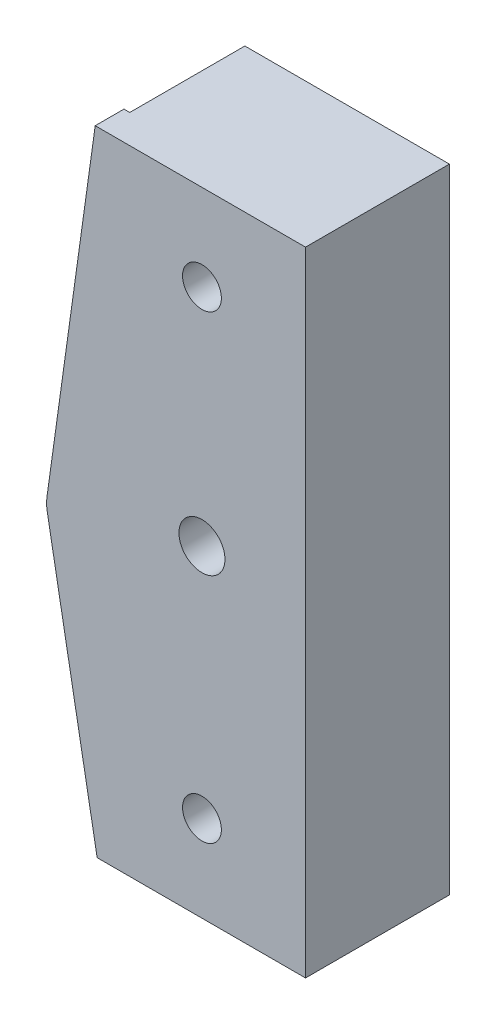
ISO-10303-21;
HEADER;
FILE_DESCRIPTION(('STEP AP214'),'2;1');
FILE_NAME('part.step','',(''),(''),'','','');
FILE_SCHEMA(('AUTOMOTIVE_DESIGN { 1 0 10303 214 1 1 1 1 }'));
ENDSEC;
DATA;
#1=APPLICATION_CONTEXT('core data for automotive mechanical design processes');
#2=APPLICATION_PROTOCOL_DEFINITION('international standard','automotive_design',2000,#1);
#3=PRODUCT_CONTEXT('',#1,'mechanical');
#4=PRODUCT('Part','Part','',(#3));
#5=PRODUCT_RELATED_PRODUCT_CATEGORY('part','',(#4));
#6=PRODUCT_DEFINITION_FORMATION('','',#4);
#7=PRODUCT_DEFINITION_CONTEXT('part definition',#1,'design');
#8=PRODUCT_DEFINITION('design','',#6,#7);
#9=PRODUCT_DEFINITION_SHAPE('','',#8);
#10=(LENGTH_UNIT() NAMED_UNIT(*) SI_UNIT(.MILLI.,.METRE.));
#11=(NAMED_UNIT(*) PLANE_ANGLE_UNIT() SI_UNIT($,.RADIAN.));
#12=(NAMED_UNIT(*) SI_UNIT($,.STERADIAN.) SOLID_ANGLE_UNIT());
#13=UNCERTAINTY_MEASURE_WITH_UNIT(LENGTH_MEASURE(1.E-05),#10,'distance_accuracy_value','');
#14=(GEOMETRIC_REPRESENTATION_CONTEXT(3) GLOBAL_UNCERTAINTY_ASSIGNED_CONTEXT((#13)) GLOBAL_UNIT_ASSIGNED_CONTEXT((#10,
#11,#12)) REPRESENTATION_CONTEXT('',''));
#15=CARTESIAN_POINT('',(0.,0.,0.));
#16=DIRECTION('',(0.,0.,1.));
#17=DIRECTION('',(1.,0.,0.));
#18=AXIS2_PLACEMENT_3D('',#15,#16,#17);
#19=CARTESIAN_POINT('',(62.9999999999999,96.5,25.));
#20=DIRECTION('',(0.,0.,-1.));
#21=DIRECTION('',(-1.,0.,0.));
#22=AXIS2_PLACEMENT_3D('',#19,#20,#21);
#23=CYLINDRICAL_SURFACE('',#22,7.00000000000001);
#24=CARTESIAN_POINT('',(62.9999999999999,96.5,20.));
#25=DIRECTION('',(0.,0.,-1.));
#26=DIRECTION('',(-1.,0.,0.));
#27=AXIS2_PLACEMENT_3D('',#24,#25,#26);
#28=CIRCLE('',#27,7.00000000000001);
#29=CARTESIAN_POINT('',(56.067236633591,97.4678802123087,20.));
#30=VERTEX_POINT('',#29);
#31=CARTESIAN_POINT('',(56.1127179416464,95.2488621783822,20.));
#32=VERTEX_POINT('',#31);
#33=EDGE_CURVE('E139',#30,#32,#28,.F.);
#34=ORIENTED_EDGE('',*,*,#33,.T.);
#35=DIRECTION('',(0.,0.,-1.));
#36=VECTOR('',#35,1.);
#37=CARTESIAN_POINT('',(56.1127179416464,95.2488621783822,25.));
#38=LINE('',#37,#36);
#39=CARTESIAN_POINT('',(56.1127179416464,95.2488621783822,25.));
#40=VERTEX_POINT('',#39);
#41=EDGE_CURVE('E40',#40,#32,#38,.T.);
#42=ORIENTED_EDGE('',*,*,#41,.F.);
#43=CARTESIAN_POINT('',(62.9999999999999,96.5,25.));
#44=DIRECTION('',(0.,0.,1.));
#45=DIRECTION('',(1.,0.,0.));
#46=AXIS2_PLACEMENT_3D('',#43,#44,#45);
#47=CIRCLE('',#46,7.00000000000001);
#48=CARTESIAN_POINT('',(56.067236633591,97.4678802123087,25.));
#49=VERTEX_POINT('',#48);
#50=EDGE_CURVE('E163',#49,#40,#47,.T.);
#51=ORIENTED_EDGE('',*,*,#50,.F.);
#52=DIRECTION('',(0.,0.,-1.));
#53=VECTOR('',#52,1.);
#54=CARTESIAN_POINT('',(56.067236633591,97.4678802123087,25.));
#55=LINE('',#54,#53);
#56=EDGE_CURVE('E174',#49,#30,#55,.T.);
#57=ORIENTED_EDGE('',*,*,#56,.T.);
#58=EDGE_LOOP('',(#34,#42,#51,#57));
#59=FACE_BOUND('',#58,.T.);
#60=ADVANCED_FACE('F33',(#59),#23,.T.);
#61=CARTESIAN_POINT('',(56.1127179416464,95.2488621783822,25.));
#62=DIRECTION('',(0.983897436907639,0.178733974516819,0.));
#63=DIRECTION('',(-0.178733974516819,0.983897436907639,0.));
#64=AXIS2_PLACEMENT_3D('',#61,#62,#63);
#65=PLANE('',#64);
#66=DIRECTION('',(0.178733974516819,-0.983897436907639,0.));
#67=VECTOR('',#66,1.);
#68=CARTESIAN_POINT('',(56.1127179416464,95.2488621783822,20.));
#69=LINE('',#68,#67);
#70=CARTESIAN_POINT('',(64.786735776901,47.5,20.));
#71=VERTEX_POINT('',#70);
#72=EDGE_CURVE('E131',#32,#71,#69,.T.);
#73=ORIENTED_EDGE('',*,*,#72,.T.);
#74=DIRECTION('',(0.,0.,-1.));
#75=VECTOR('',#74,1.);
#76=CARTESIAN_POINT('',(64.786735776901,47.5,25.));
#77=LINE('',#76,#75);
#78=CARTESIAN_POINT('',(64.786735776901,47.5,25.));
#79=VERTEX_POINT('',#78);
#80=EDGE_CURVE('E186',#79,#71,#77,.T.);
#81=ORIENTED_EDGE('',*,*,#80,.F.);
#82=DIRECTION('',(0.178733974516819,-0.983897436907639,0.));
#83=VECTOR('',#82,1.);
#84=CARTESIAN_POINT('',(56.1127179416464,95.2488621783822,25.));
#85=LINE('',#84,#83);
#86=EDGE_CURVE('E165',#40,#79,#85,.T.);
#87=ORIENTED_EDGE('',*,*,#86,.F.);
#88=ORIENTED_EDGE('',*,*,#41,.T.);
#89=EDGE_LOOP('',(#73,#81,#87,#88));
#90=FACE_BOUND('',#89,.T.);
#91=ADVANCED_FACE('F191',(#90),#65,.F.);
#92=CARTESIAN_POINT('',(64.448295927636,157.5,25.));
#93=DIRECTION('',(0.990394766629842,-0.138268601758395,0.));
#94=DIRECTION('',(0.138268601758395,0.990394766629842,0.));
#95=AXIS2_PLACEMENT_3D('',#92,#93,#94);
#96=PLANE('',#95);
#97=DIRECTION('',(-0.138268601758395,-0.990394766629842,0.));
#98=VECTOR('',#97,1.);
#99=CARTESIAN_POINT('',(66.0809221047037,169.194227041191,20.));
#100=LINE('',#99,#98);
#101=CARTESIAN_POINT('',(64.448295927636,157.5,20.));
#102=VERTEX_POINT('',#101);
#103=EDGE_CURVE('E142',#102,#30,#100,.T.);
#104=ORIENTED_EDGE('',*,*,#103,.T.);
#105=ORIENTED_EDGE('',*,*,#56,.F.);
#106=DIRECTION('',(-0.138268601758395,-0.990394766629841,0.));
#107=VECTOR('',#106,1.);
#108=CARTESIAN_POINT('',(64.448295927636,157.5,25.));
#109=LINE('',#108,#107);
#110=CARTESIAN_POINT('',(64.448295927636,157.5,25.));
#111=VERTEX_POINT('',#110);
#112=EDGE_CURVE('E54',#111,#49,#109,.T.);
#113=ORIENTED_EDGE('',*,*,#112,.F.);
#114=DIRECTION('',(0.,0.,-1.));
#115=VECTOR('',#114,1.);
#116=CARTESIAN_POINT('',(64.448295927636,157.5,25.));
#117=LINE('',#116,#115);
#118=EDGE_CURVE('E177',#111,#102,#117,.T.);
#119=ORIENTED_EDGE('',*,*,#118,.T.);
#120=EDGE_LOOP('',(#104,#105,#113,#119));
#121=FACE_BOUND('',#120,.T.);
#122=ADVANCED_FACE('F199',(#121),#96,.F.);
#123=CARTESIAN_POINT('',(64.786735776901,47.5,25.));
#124=DIRECTION('',(0.,1.,0.));
#125=DIRECTION('',(-1.,0.,0.));
#126=AXIS2_PLACEMENT_3D('',#123,#124,#125);
#127=PLANE('',#126);
#128=DIRECTION('',(-1.,0.,0.));
#129=VECTOR('',#128,1.);
#130=CARTESIAN_POINT('',(64.786735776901,47.5,20.));
#131=LINE('',#130,#129);
#132=CARTESIAN_POINT('',(65.8031018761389,47.5,20.));
#133=VERTEX_POINT('',#132);
#134=EDGE_CURVE('E155',#133,#71,#131,.T.);
#135=ORIENTED_EDGE('',*,*,#134,.F.);
#136=DIRECTION('',(0.,0.,-1.));
#137=VECTOR('',#136,1.);
#138=CARTESIAN_POINT('',(65.8031018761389,47.5,25.));
#139=LINE('',#138,#137);
#140=CARTESIAN_POINT('',(65.8031018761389,47.5,0.));
#141=VERTEX_POINT('',#140);
#142=EDGE_CURVE('E150',#133,#141,#139,.T.);
#143=ORIENTED_EDGE('',*,*,#142,.T.);
#144=DIRECTION('',(1.,0.,0.));
#145=VECTOR('',#144,1.);
#146=CARTESIAN_POINT('',(64.786735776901,47.5,0.));
#147=LINE('',#146,#145);
#148=CARTESIAN_POINT('',(101.,47.5,0.));
#149=VERTEX_POINT('',#148);
#150=EDGE_CURVE('E157',#141,#149,#147,.T.);
#151=ORIENTED_EDGE('',*,*,#150,.T.);
#152=DIRECTION('',(0.,0.,-1.));
#153=VECTOR('',#152,1.);
#154=CARTESIAN_POINT('',(101.,47.5,25.));
#155=LINE('',#154,#153);
#156=CARTESIAN_POINT('',(101.,47.5,25.));
#157=VERTEX_POINT('',#156);
#158=EDGE_CURVE('E183',#157,#149,#155,.T.);
#159=ORIENTED_EDGE('',*,*,#158,.F.);
#160=DIRECTION('',(1.,0.,0.));
#161=VECTOR('',#160,1.);
#162=CARTESIAN_POINT('',(64.786735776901,47.5,25.));
#163=LINE('',#162,#161);
#164=EDGE_CURVE('E167',#79,#157,#163,.T.);
#165=ORIENTED_EDGE('',*,*,#164,.F.);
#166=ORIENTED_EDGE('',*,*,#80,.T.);
#167=EDGE_LOOP('',(#135,#143,#151,#159,#165,#166));
#168=FACE_BOUND('',#167,.T.);
#169=ADVANCED_FACE('F208',(#168),#127,.F.);
#170=CARTESIAN_POINT('',(101.,157.5,25.));
#171=DIRECTION('',(-1.,0.,0.));
#172=DIRECTION('',(0.,0.,1.));
#173=AXIS2_PLACEMENT_3D('',#170,#171,#172);
#174=PLANE('',#173);
#175=DIRECTION('',(0.,1.,0.));
#176=VECTOR('',#175,1.);
#177=CARTESIAN_POINT('',(101.,157.5,0.));
#178=LINE('',#177,#176);
#179=CARTESIAN_POINT('',(101.,157.5,0.));
#180=VERTEX_POINT('',#179);
#181=EDGE_CURVE('E159',#149,#180,#178,.T.);
#182=ORIENTED_EDGE('',*,*,#181,.T.);
#183=DIRECTION('',(0.,0.,-1.));
#184=VECTOR('',#183,1.);
#185=CARTESIAN_POINT('',(101.,157.5,25.));
#186=LINE('',#185,#184);
#187=CARTESIAN_POINT('',(101.,157.5,25.));
#188=VERTEX_POINT('',#187);
#189=EDGE_CURVE('E180',#188,#180,#186,.T.);
#190=ORIENTED_EDGE('',*,*,#189,.F.);
#191=DIRECTION('',(0.,1.,0.));
#192=VECTOR('',#191,1.);
#193=CARTESIAN_POINT('',(101.,157.5,25.));
#194=LINE('',#193,#192);
#195=EDGE_CURVE('E169',#157,#188,#194,.T.);
#196=ORIENTED_EDGE('',*,*,#195,.F.);
#197=ORIENTED_EDGE('',*,*,#158,.T.);
#198=EDGE_LOOP('',(#182,#190,#196,#197));
#199=FACE_BOUND('',#198,.T.);
#200=ADVANCED_FACE('F215',(#199),#174,.F.);
#201=CARTESIAN_POINT('',(101.,157.5,25.));
#202=DIRECTION('',(0.,-1.,0.));
#203=DIRECTION('',(0.,0.,-1.));
#204=AXIS2_PLACEMENT_3D('',#201,#202,#203);
#205=PLANE('',#204);
#206=DIRECTION('',(-1.,0.,0.));
#207=VECTOR('',#206,1.);
#208=CARTESIAN_POINT('',(101.,157.5,0.));
#209=LINE('',#208,#207);
#210=CARTESIAN_POINT('',(65.4579943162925,157.5,0.));
#211=VERTEX_POINT('',#210);
#212=EDGE_CURVE('E161',#180,#211,#209,.T.);
#213=ORIENTED_EDGE('',*,*,#212,.T.);
#214=DIRECTION('',(0.,0.,1.));
#215=VECTOR('',#214,1.);
#216=CARTESIAN_POINT('',(65.4579943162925,157.5,25.));
#217=LINE('',#216,#215);
#218=CARTESIAN_POINT('',(65.4579943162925,157.5,20.));
#219=VERTEX_POINT('',#218);
#220=EDGE_CURVE('E47',#211,#219,#217,.T.);
#221=ORIENTED_EDGE('',*,*,#220,.T.);
#222=DIRECTION('',(1.,0.,0.));
#223=VECTOR('',#222,1.);
#224=CARTESIAN_POINT('',(101.,157.5,20.));
#225=LINE('',#224,#223);
#226=EDGE_CURVE('E153',#102,#219,#225,.T.);
#227=ORIENTED_EDGE('',*,*,#226,.F.);
#228=ORIENTED_EDGE('',*,*,#118,.F.);
#229=DIRECTION('',(-1.,0.,0.));
#230=VECTOR('',#229,1.);
#231=CARTESIAN_POINT('',(101.,157.5,25.));
#232=LINE('',#231,#230);
#233=EDGE_CURVE('E171',#188,#111,#232,.T.);
#234=ORIENTED_EDGE('',*,*,#233,.F.);
#235=ORIENTED_EDGE('',*,*,#189,.T.);
#236=EDGE_LOOP('',(#213,#221,#227,#228,#234,#235));
#237=FACE_BOUND('',#236,.T.);
#238=ADVANCED_FACE('F203',(#237),#205,.F.);
#239=CARTESIAN_POINT('',(62.9999999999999,96.5,25.));
#240=DIRECTION('',(0.,0.,1.));
#241=DIRECTION('',(1.,0.,0.));
#242=AXIS2_PLACEMENT_3D('',#239,#240,#241);
#243=PLANE('',#242);
#244=CARTESIAN_POINT('',(83.,62.5,25.));
#245=DIRECTION('',(0.,0.,-1.));
#246=DIRECTION('',(-1.,0.,0.));
#247=AXIS2_PLACEMENT_3D('',#244,#245,#246);
#248=CIRCLE('',#247,3.375);
#249=CARTESIAN_POINT('',(79.625,62.5,25.));
#250=VERTEX_POINT('',#249);
#251=EDGE_CURVE('E267',#250,#250,#248,.T.);
#252=ORIENTED_EDGE('',*,*,#251,.T.);
#253=EDGE_LOOP('',(#252));
#254=FACE_BOUND('',#253,.T.);
#255=CARTESIAN_POINT('',(83.,103.5,25.));
#256=DIRECTION('',(0.,0.,-1.));
#257=DIRECTION('',(-1.,0.,0.));
#258=AXIS2_PLACEMENT_3D('',#255,#256,#257);
#259=CIRCLE('',#258,4.00000000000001);
#260=CARTESIAN_POINT('',(79.,103.5,25.));
#261=VERTEX_POINT('',#260);
#262=EDGE_CURVE('E277',#261,#261,#259,.T.);
#263=ORIENTED_EDGE('',*,*,#262,.T.);
#264=EDGE_LOOP('',(#263));
#265=FACE_BOUND('',#264,.T.);
#266=CARTESIAN_POINT('',(83.,142.5,25.));
#267=DIRECTION('',(0.,0.,-1.));
#268=DIRECTION('',(-1.,0.,0.));
#269=AXIS2_PLACEMENT_3D('',#266,#267,#268);
#270=CIRCLE('',#269,3.375);
#271=CARTESIAN_POINT('',(79.625,142.5,25.));
#272=VERTEX_POINT('',#271);
#273=EDGE_CURVE('E133',#272,#272,#270,.T.);
#274=ORIENTED_EDGE('',*,*,#273,.T.);
#275=EDGE_LOOP('',(#274));
#276=FACE_BOUND('',#275,.T.);
#277=ORIENTED_EDGE('',*,*,#50,.T.);
#278=ORIENTED_EDGE('',*,*,#86,.T.);
#279=ORIENTED_EDGE('',*,*,#164,.T.);
#280=ORIENTED_EDGE('',*,*,#195,.T.);
#281=ORIENTED_EDGE('',*,*,#233,.T.);
#282=ORIENTED_EDGE('',*,*,#112,.T.);
#283=EDGE_LOOP('',(#277,#278,#279,#280,#281,#282));
#284=FACE_BOUND('',#283,.T.);
#285=ADVANCED_FACE('F212',(#254,#265,#276,#284),#243,.T.);
#286=CARTESIAN_POINT('',(62.9999999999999,96.5,0.));
#287=DIRECTION('',(0.,0.,1.));
#288=DIRECTION('',(1.,0.,0.));
#289=AXIS2_PLACEMENT_3D('',#286,#287,#288);
#290=PLANE('',#289);
#291=CARTESIAN_POINT('',(83.,62.5,0.));
#292=DIRECTION('',(0.,0.,-1.));
#293=DIRECTION('',(-1.,0.,0.));
#294=AXIS2_PLACEMENT_3D('',#291,#292,#293);
#295=CIRCLE('',#294,3.375);
#296=CARTESIAN_POINT('',(79.625,62.5,0.));
#297=VERTEX_POINT('',#296);
#298=EDGE_CURVE('E270',#297,#297,#295,.T.);
#299=ORIENTED_EDGE('',*,*,#298,.F.);
#300=EDGE_LOOP('',(#299));
#301=FACE_BOUND('',#300,.T.);
#302=CARTESIAN_POINT('',(83.,103.5,0.));
#303=DIRECTION('',(0.,0.,-1.));
#304=DIRECTION('',(-1.,0.,0.));
#305=AXIS2_PLACEMENT_3D('',#302,#303,#304);
#306=CIRCLE('',#305,4.00000000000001);
#307=CARTESIAN_POINT('',(79.,103.5,0.));
#308=VERTEX_POINT('',#307);
#309=EDGE_CURVE('E272',#308,#308,#306,.T.);
#310=ORIENTED_EDGE('',*,*,#309,.F.);
#311=EDGE_LOOP('',(#310));
#312=FACE_BOUND('',#311,.T.);
#313=CARTESIAN_POINT('',(83.,142.5,0.));
#314=DIRECTION('',(0.,0.,-1.));
#315=DIRECTION('',(-1.,0.,0.));
#316=AXIS2_PLACEMENT_3D('',#313,#314,#315);
#317=CIRCLE('',#316,3.375);
#318=CARTESIAN_POINT('',(79.625,142.5,0.));
#319=VERTEX_POINT('',#318);
#320=EDGE_CURVE('E280',#319,#319,#317,.T.);
#321=ORIENTED_EDGE('',*,*,#320,.F.);
#322=EDGE_LOOP('',(#321));
#323=FACE_BOUND('',#322,.T.);
#324=ORIENTED_EDGE('',*,*,#150,.F.);
#325=DIRECTION('',(0.178733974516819,-0.983897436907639,0.));
#326=VECTOR('',#325,1.);
#327=CARTESIAN_POINT('',(57.0966153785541,95.4275961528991,0.));
#328=LINE('',#327,#326);
#329=CARTESIAN_POINT('',(57.0966153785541,95.4275961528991,0.));
#330=VERTEX_POINT('',#329);
#331=EDGE_CURVE('E127',#330,#141,#328,.T.);
#332=ORIENTED_EDGE('',*,*,#331,.F.);
#333=CARTESIAN_POINT('',(62.9999999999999,96.5,0.));
#334=DIRECTION('',(0.,0.,1.));
#335=DIRECTION('',(-1.,0.,0.));
#336=AXIS2_PLACEMENT_3D('',#333,#334,#335);
#337=CIRCLE('',#336,6.00000000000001);
#338=CARTESIAN_POINT('',(57.0576314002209,97.3296116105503,0.));
#339=VERTEX_POINT('',#338);
#340=EDGE_CURVE('E119',#339,#330,#337,.T.);
#341=ORIENTED_EDGE('',*,*,#340,.F.);
#342=DIRECTION('',(0.138268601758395,0.990394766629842,0.));
#343=VECTOR('',#342,1.);
#344=CARTESIAN_POINT('',(57.0576314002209,97.3296116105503,0.));
#345=LINE('',#344,#343);
#346=EDGE_CURVE('E11',#339,#211,#345,.T.);
#347=ORIENTED_EDGE('',*,*,#346,.T.);
#348=ORIENTED_EDGE('',*,*,#212,.F.);
#349=ORIENTED_EDGE('',*,*,#181,.F.);
#350=EDGE_LOOP('',(#324,#332,#341,#347,#348,#349));
#351=FACE_BOUND('',#350,.T.);
#352=ADVANCED_FACE('F126',(#301,#312,#323,#351),#290,.F.);
#353=CARTESIAN_POINT('',(62.9999999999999,96.5,20.));
#354=DIRECTION('',(0.,0.,-1.));
#355=DIRECTION('',(-1.,0.,0.));
#356=AXIS2_PLACEMENT_3D('',#353,#354,#355);
#357=PLANE('',#356);
#358=ORIENTED_EDGE('',*,*,#134,.T.);
#359=ORIENTED_EDGE('',*,*,#72,.F.);
#360=ORIENTED_EDGE('',*,*,#33,.F.);
#361=ORIENTED_EDGE('',*,*,#103,.F.);
#362=ORIENTED_EDGE('',*,*,#226,.T.);
#363=DIRECTION('',(-0.138268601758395,-0.990394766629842,0.));
#364=VECTOR('',#363,1.);
#365=CARTESIAN_POINT('',(67.0713168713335,169.055958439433,20.));
#366=LINE('',#365,#364);
#367=CARTESIAN_POINT('',(57.0576314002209,97.3296116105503,20.));
#368=VERTEX_POINT('',#367);
#369=EDGE_CURVE('E145',#219,#368,#366,.T.);
#370=ORIENTED_EDGE('',*,*,#369,.T.);
#371=CARTESIAN_POINT('',(62.9999999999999,96.5,20.));
#372=DIRECTION('',(0.,0.,1.));
#373=DIRECTION('',(-1.,0.,0.));
#374=AXIS2_PLACEMENT_3D('',#371,#372,#373);
#375=CIRCLE('',#374,6.00000000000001);
#376=CARTESIAN_POINT('',(57.0966153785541,95.4275961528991,20.));
#377=VERTEX_POINT('',#376);
#378=EDGE_CURVE('E122',#368,#377,#375,.T.);
#379=ORIENTED_EDGE('',*,*,#378,.T.);
#380=DIRECTION('',(0.178733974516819,-0.983897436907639,0.));
#381=VECTOR('',#380,1.);
#382=CARTESIAN_POINT('',(57.0966153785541,95.4275961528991,20.));
#383=LINE('',#382,#381);
#384=EDGE_CURVE('E128',#377,#133,#383,.T.);
#385=ORIENTED_EDGE('',*,*,#384,.T.);
#386=EDGE_LOOP('',(#358,#359,#360,#361,#362,#370,#379,#385));
#387=FACE_BOUND('',#386,.T.);
#388=ADVANCED_FACE('F196',(#387),#357,.T.);
#389=CARTESIAN_POINT('',(57.0966153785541,95.4275961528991,20.));
#390=DIRECTION('',(0.983897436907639,0.178733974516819,0.));
#391=DIRECTION('',(-0.178733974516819,0.983897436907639,0.));
#392=AXIS2_PLACEMENT_3D('',#389,#390,#391);
#393=PLANE('',#392);
#394=ORIENTED_EDGE('',*,*,#384,.F.);
#395=DIRECTION('',(0.,0.,-1.));
#396=VECTOR('',#395,1.);
#397=CARTESIAN_POINT('',(57.0966153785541,95.4275961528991,20.));
#398=LINE('',#397,#396);
#399=EDGE_CURVE('E123',#377,#330,#398,.T.);
#400=ORIENTED_EDGE('',*,*,#399,.T.);
#401=ORIENTED_EDGE('',*,*,#331,.T.);
#402=ORIENTED_EDGE('',*,*,#142,.F.);
#403=EDGE_LOOP('',(#394,#400,#401,#402));
#404=FACE_BOUND('',#403,.T.);
#405=ADVANCED_FACE('F242',(#404),#393,.F.);
#406=CARTESIAN_POINT('',(67.0713168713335,169.055958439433,20.));
#407=DIRECTION('',(0.990394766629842,-0.138268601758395,0.));
#408=DIRECTION('',(0.138268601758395,0.990394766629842,0.));
#409=AXIS2_PLACEMENT_3D('',#406,#407,#408);
#410=PLANE('',#409);
#411=ORIENTED_EDGE('',*,*,#346,.F.);
#412=DIRECTION('',(0.,0.,-1.));
#413=VECTOR('',#412,1.);
#414=CARTESIAN_POINT('',(57.0576314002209,97.3296116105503,20.));
#415=LINE('',#414,#413);
#416=EDGE_CURVE('E110',#368,#339,#415,.T.);
#417=ORIENTED_EDGE('',*,*,#416,.F.);
#418=ORIENTED_EDGE('',*,*,#369,.F.);
#419=ORIENTED_EDGE('',*,*,#220,.F.);
#420=EDGE_LOOP('',(#411,#417,#418,#419));
#421=FACE_BOUND('',#420,.T.);
#422=ADVANCED_FACE('F109',(#421),#410,.F.);
#423=CARTESIAN_POINT('',(62.9999999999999,96.5,20.));
#424=DIRECTION('',(0.,0.,-1.));
#425=DIRECTION('',(-1.,0.,0.));
#426=AXIS2_PLACEMENT_3D('',#423,#424,#425);
#427=CYLINDRICAL_SURFACE('',#426,6.00000000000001);
#428=ORIENTED_EDGE('',*,*,#340,.T.);
#429=ORIENTED_EDGE('',*,*,#399,.F.);
#430=ORIENTED_EDGE('',*,*,#378,.F.);
#431=ORIENTED_EDGE('',*,*,#416,.T.);
#432=EDGE_LOOP('',(#428,#429,#430,#431));
#433=FACE_BOUND('',#432,.T.);
#434=ADVANCED_FACE('F118',(#433),#427,.T.);
#435=CARTESIAN_POINT('',(83.,142.5,25.));
#436=DIRECTION('',(0.,0.,-1.));
#437=DIRECTION('',(-1.,0.,0.));
#438=AXIS2_PLACEMENT_3D('',#435,#436,#437);
#439=CYLINDRICAL_SURFACE('',#438,3.375);
#440=ORIENTED_EDGE('',*,*,#273,.F.);
#441=EDGE_LOOP('',(#440));
#442=FACE_BOUND('',#441,.T.);
#443=ORIENTED_EDGE('',*,*,#320,.T.);
#444=EDGE_LOOP('',(#443));
#445=FACE_BOUND('',#444,.T.);
#446=ADVANCED_FACE('F249',(#442,#445),#439,.F.);
#447=CARTESIAN_POINT('',(83.,103.5,25.));
#448=DIRECTION('',(0.,0.,-1.));
#449=DIRECTION('',(-1.,0.,0.));
#450=AXIS2_PLACEMENT_3D('',#447,#448,#449);
#451=CYLINDRICAL_SURFACE('',#450,4.00000000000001);
#452=ORIENTED_EDGE('',*,*,#262,.F.);
#453=EDGE_LOOP('',(#452));
#454=FACE_BOUND('',#453,.T.);
#455=ORIENTED_EDGE('',*,*,#309,.T.);
#456=EDGE_LOOP('',(#455));
#457=FACE_BOUND('',#456,.T.);
#458=ADVANCED_FACE('F254',(#454,#457),#451,.F.);
#459=CARTESIAN_POINT('',(83.,62.5,25.));
#460=DIRECTION('',(0.,0.,-1.));
#461=DIRECTION('',(-1.,0.,0.));
#462=AXIS2_PLACEMENT_3D('',#459,#460,#461);
#463=CYLINDRICAL_SURFACE('',#462,3.375);
#464=ORIENTED_EDGE('',*,*,#251,.F.);
#465=EDGE_LOOP('',(#464));
#466=FACE_BOUND('',#465,.T.);
#467=ORIENTED_EDGE('',*,*,#298,.T.);
#468=EDGE_LOOP('',(#467));
#469=FACE_BOUND('',#468,.T.);
#470=ADVANCED_FACE('F258',(#466,#469),#463,.F.);
#471=CLOSED_SHELL('',(#60,#91,#122,#169,#200,#238,#285,#352,#388,#405,#422,#434,#446,#458,#470));
#472=MANIFOLD_SOLID_BREP('B2',#471);
#473=ADVANCED_BREP_SHAPE_REPRESENTATION('',(#18,#472),#14);
#474=SHAPE_DEFINITION_REPRESENTATION(#9,#473);
ENDSEC;
END-ISO-10303-21;
